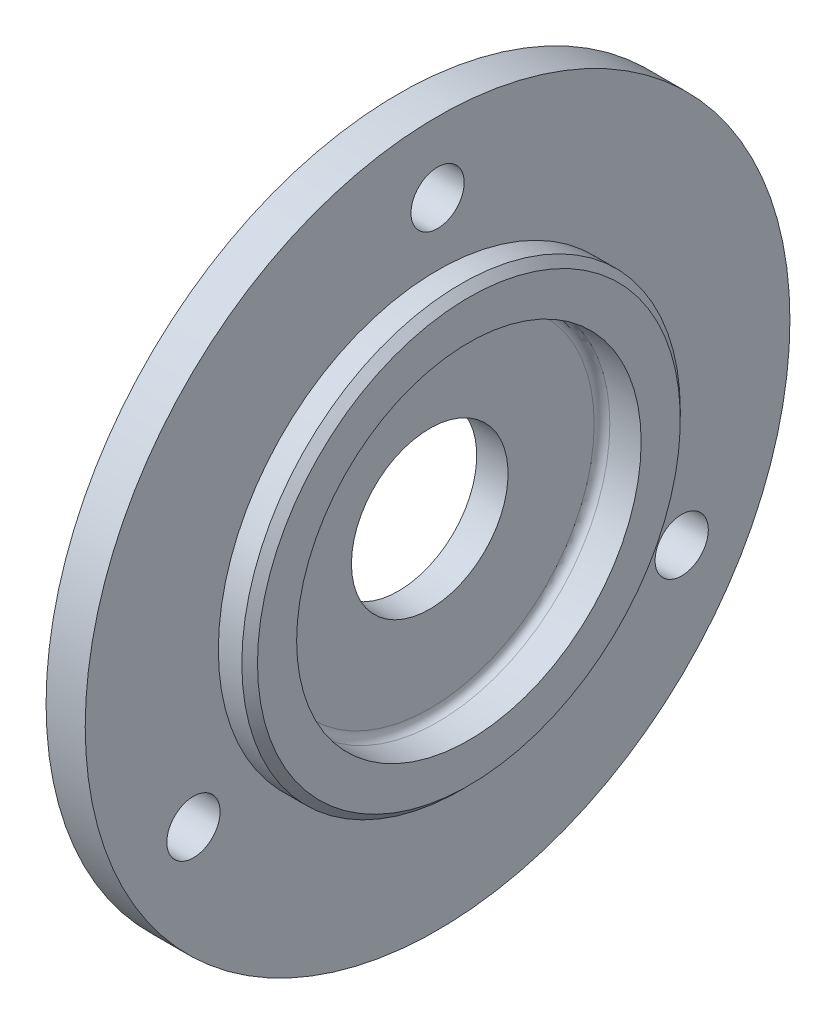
ISO-10303-21;
HEADER;
FILE_DESCRIPTION(('STEP AP214'),'2;1');
FILE_NAME('part.step','',(''),(''),'','','');
FILE_SCHEMA(('AUTOMOTIVE_DESIGN { 1 0 10303 214 1 1 1 1 }'));
ENDSEC;
DATA;
#1=APPLICATION_CONTEXT('core data for automotive mechanical design processes');
#2=APPLICATION_PROTOCOL_DEFINITION('international standard','automotive_design',2000,#1);
#3=PRODUCT_CONTEXT('',#1,'mechanical');
#4=PRODUCT('Part','Part','',(#3));
#5=PRODUCT_RELATED_PRODUCT_CATEGORY('part','',(#4));
#6=PRODUCT_DEFINITION_FORMATION('','',#4);
#7=PRODUCT_DEFINITION_CONTEXT('part definition',#1,'design');
#8=PRODUCT_DEFINITION('design','',#6,#7);
#9=PRODUCT_DEFINITION_SHAPE('','',#8);
#10=(LENGTH_UNIT() NAMED_UNIT(*) SI_UNIT(.MILLI.,.METRE.));
#11=(NAMED_UNIT(*) PLANE_ANGLE_UNIT() SI_UNIT($,.RADIAN.));
#12=(NAMED_UNIT(*) SI_UNIT($,.STERADIAN.) SOLID_ANGLE_UNIT());
#13=UNCERTAINTY_MEASURE_WITH_UNIT(LENGTH_MEASURE(1.E-05),#10,'distance_accuracy_value','');
#14=(GEOMETRIC_REPRESENTATION_CONTEXT(3) GLOBAL_UNCERTAINTY_ASSIGNED_CONTEXT((#13)) GLOBAL_UNIT_ASSIGNED_CONTEXT((#10,
#11,#12)) REPRESENTATION_CONTEXT('',''));
#15=CARTESIAN_POINT('',(0.,0.,0.));
#16=DIRECTION('',(0.,0.,1.));
#17=DIRECTION('',(1.,0.,0.));
#18=AXIS2_PLACEMENT_3D('',#15,#16,#17);
#19=CARTESIAN_POINT('',(-14.777796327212,0.,0.));
#20=DIRECTION('',(-1.,0.,0.));
#21=DIRECTION('',(0.,0.,1.));
#22=AXIS2_PLACEMENT_3D('',#19,#20,#21);
#23=CYLINDRICAL_SURFACE('',#22,5.);
#24=CARTESIAN_POINT('',(-0.499999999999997,0.,0.));
#25=DIRECTION('',(-1.,0.,0.));
#26=DIRECTION('',(0.,0.,1.));
#27=AXIS2_PLACEMENT_3D('',#24,#25,#26);
#28=CIRCLE('',#27,5.);
#29=CARTESIAN_POINT('',(-0.499999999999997,0.,5.));
#30=VERTEX_POINT('',#29);
#31=EDGE_CURVE('E65',#30,#30,#28,.T.);
#32=ORIENTED_EDGE('',*,*,#31,.F.);
#33=EDGE_LOOP('',(#32));
#34=FACE_BOUND('',#33,.T.);
#35=CARTESIAN_POINT('',(-2.5,0.,0.));
#36=DIRECTION('',(-1.,0.,0.));
#37=DIRECTION('',(0.,0.,1.));
#38=AXIS2_PLACEMENT_3D('',#35,#36,#37);
#39=CIRCLE('',#38,5.);
#40=CARTESIAN_POINT('',(-2.5,0.,5.));
#41=VERTEX_POINT('',#40);
#42=EDGE_CURVE('E10',#41,#41,#39,.T.);
#43=ORIENTED_EDGE('',*,*,#42,.T.);
#44=EDGE_LOOP('',(#43));
#45=FACE_BOUND('',#44,.T.);
#46=ADVANCED_FACE('F31',(#34,#45),#23,.F.);
#47=CARTESIAN_POINT('',(-2.5,22.5,0.));
#48=DIRECTION('',(1.,0.,0.));
#49=DIRECTION('',(0.,0.,-1.));
#50=AXIS2_PLACEMENT_3D('',#47,#48,#49);
#51=PLANE('',#50);
#52=CARTESIAN_POINT('',(-2.5,-8.99999999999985,15.58845726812));
#53=DIRECTION('',(1.,0.,0.));
#54=DIRECTION('',(0.,0.,-1.));
#55=AXIS2_PLACEMENT_3D('',#52,#53,#54);
#56=CIRCLE('',#55,1.7);
#57=CARTESIAN_POINT('',(-2.5,-8.99999999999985,13.88845726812));
#58=VERTEX_POINT('',#57);
#59=EDGE_CURVE('E80',#58,#58,#56,.T.);
#60=ORIENTED_EDGE('',*,*,#59,.T.);
#61=EDGE_LOOP('',(#60));
#62=FACE_BOUND('',#61,.T.);
#63=CARTESIAN_POINT('',(-2.5,-9.00000000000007,-15.5884572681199));
#64=DIRECTION('',(1.,0.,0.));
#65=DIRECTION('',(0.,0.,-1.));
#66=AXIS2_PLACEMENT_3D('',#63,#64,#65);
#67=CIRCLE('',#66,1.7);
#68=CARTESIAN_POINT('',(-2.5,-9.00000000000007,-17.2884572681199));
#69=VERTEX_POINT('',#68);
#70=EDGE_CURVE('E74',#69,#69,#67,.T.);
#71=ORIENTED_EDGE('',*,*,#70,.T.);
#72=EDGE_LOOP('',(#71));
#73=FACE_BOUND('',#72,.T.);
#74=CARTESIAN_POINT('',(-2.5,18.,0.));
#75=DIRECTION('',(1.,0.,0.));
#76=DIRECTION('',(0.,0.,-1.));
#77=AXIS2_PLACEMENT_3D('',#74,#75,#76);
#78=CIRCLE('',#77,1.7);
#79=CARTESIAN_POINT('',(-2.5,18.,-1.7));
#80=VERTEX_POINT('',#79);
#81=EDGE_CURVE('E68',#80,#80,#78,.T.);
#82=ORIENTED_EDGE('',*,*,#81,.T.);
#83=EDGE_LOOP('',(#82));
#84=FACE_BOUND('',#83,.T.);
#85=ORIENTED_EDGE('',*,*,#42,.F.);
#86=EDGE_LOOP('',(#85));
#87=FACE_BOUND('',#86,.T.);
#88=CARTESIAN_POINT('',(-2.5,0.,0.));
#89=DIRECTION('',(-1.,0.,0.));
#90=DIRECTION('',(0.,0.,1.));
#91=AXIS2_PLACEMENT_3D('',#88,#89,#90);
#92=CIRCLE('',#91,22.5);
#93=CARTESIAN_POINT('',(-2.5,0.,22.5));
#94=VERTEX_POINT('',#93);
#95=EDGE_CURVE('E37',#94,#94,#92,.T.);
#96=ORIENTED_EDGE('',*,*,#95,.T.);
#97=EDGE_LOOP('',(#96));
#98=FACE_BOUND('',#97,.T.);
#99=ADVANCED_FACE('F141',(#62,#73,#84,#87,#98),#51,.F.);
#100=CARTESIAN_POINT('',(-14.777796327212,0.,0.));
#101=DIRECTION('',(-1.,0.,0.));
#102=DIRECTION('',(0.,0.,1.));
#103=AXIS2_PLACEMENT_3D('',#100,#101,#102);
#104=CYLINDRICAL_SURFACE('',#103,22.5);
#105=ORIENTED_EDGE('',*,*,#95,.F.);
#106=EDGE_LOOP('',(#105));
#107=FACE_BOUND('',#106,.T.);
#108=CARTESIAN_POINT('',(0.,0.,0.));
#109=DIRECTION('',(-1.,0.,0.));
#110=DIRECTION('',(0.,0.,1.));
#111=AXIS2_PLACEMENT_3D('',#108,#109,#110);
#112=CIRCLE('',#111,22.5);
#113=CARTESIAN_POINT('',(0.,0.,22.5));
#114=VERTEX_POINT('',#113);
#115=EDGE_CURVE('E41',#114,#114,#112,.T.);
#116=ORIENTED_EDGE('',*,*,#115,.T.);
#117=EDGE_LOOP('',(#116));
#118=FACE_BOUND('',#117,.T.);
#119=ADVANCED_FACE('F94',(#107,#118),#104,.T.);
#120=CARTESIAN_POINT('',(0.,14.,0.));
#121=DIRECTION('',(-1.,0.,0.));
#122=DIRECTION('',(0.,0.,1.));
#123=AXIS2_PLACEMENT_3D('',#120,#121,#122);
#124=PLANE('',#123);
#125=CARTESIAN_POINT('',(0.,-8.99999999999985,15.58845726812));
#126=DIRECTION('',(1.,0.,0.));
#127=DIRECTION('',(0.,0.,-1.));
#128=AXIS2_PLACEMENT_3D('',#125,#126,#127);
#129=CIRCLE('',#128,1.7);
#130=CARTESIAN_POINT('',(0.,-8.99999999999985,13.88845726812));
#131=VERTEX_POINT('',#130);
#132=EDGE_CURVE('E83',#131,#131,#129,.T.);
#133=ORIENTED_EDGE('',*,*,#132,.F.);
#134=EDGE_LOOP('',(#133));
#135=FACE_BOUND('',#134,.T.);
#136=CARTESIAN_POINT('',(0.,-9.00000000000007,-15.5884572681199));
#137=DIRECTION('',(1.,0.,0.));
#138=DIRECTION('',(0.,0.,-1.));
#139=AXIS2_PLACEMENT_3D('',#136,#137,#138);
#140=CIRCLE('',#139,1.7);
#141=CARTESIAN_POINT('',(0.,-9.00000000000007,-17.2884572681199));
#142=VERTEX_POINT('',#141);
#143=EDGE_CURVE('E77',#142,#142,#140,.T.);
#144=ORIENTED_EDGE('',*,*,#143,.F.);
#145=EDGE_LOOP('',(#144));
#146=FACE_BOUND('',#145,.T.);
#147=CARTESIAN_POINT('',(0.,18.,0.));
#148=DIRECTION('',(1.,0.,0.));
#149=DIRECTION('',(0.,0.,-1.));
#150=AXIS2_PLACEMENT_3D('',#147,#148,#149);
#151=CIRCLE('',#150,1.7);
#152=CARTESIAN_POINT('',(0.,18.,-1.7));
#153=VERTEX_POINT('',#152);
#154=EDGE_CURVE('E71',#153,#153,#151,.T.);
#155=ORIENTED_EDGE('',*,*,#154,.F.);
#156=EDGE_LOOP('',(#155));
#157=FACE_BOUND('',#156,.T.);
#158=ORIENTED_EDGE('',*,*,#115,.F.);
#159=EDGE_LOOP('',(#158));
#160=FACE_BOUND('',#159,.T.);
#161=CARTESIAN_POINT('',(0.,0.,0.));
#162=DIRECTION('',(-1.,0.,0.));
#163=DIRECTION('',(0.,0.,1.));
#164=AXIS2_PLACEMENT_3D('',#161,#162,#163);
#165=CIRCLE('',#164,14.);
#166=CARTESIAN_POINT('',(0.,0.,14.));
#167=VERTEX_POINT('',#166);
#168=EDGE_CURVE('E45',#167,#167,#165,.T.);
#169=ORIENTED_EDGE('',*,*,#168,.T.);
#170=EDGE_LOOP('',(#169));
#171=FACE_BOUND('',#170,.T.);
#172=ADVANCED_FACE('F90',(#135,#146,#157,#160,#171),#124,.F.);
#173=CARTESIAN_POINT('',(-14.777796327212,0.,0.));
#174=DIRECTION('',(-1.,0.,0.));
#175=DIRECTION('',(0.,0.,1.));
#176=AXIS2_PLACEMENT_3D('',#173,#174,#175);
#177=CYLINDRICAL_SURFACE('',#176,14.);
#178=ORIENTED_EDGE('',*,*,#168,.F.);
#179=EDGE_LOOP('',(#178));
#180=FACE_BOUND('',#179,.T.);
#181=CARTESIAN_POINT('',(1.5,0.,0.));
#182=DIRECTION('',(-1.,0.,0.));
#183=DIRECTION('',(0.,0.,1.));
#184=AXIS2_PLACEMENT_3D('',#181,#182,#183);
#185=CIRCLE('',#184,14.);
#186=CARTESIAN_POINT('',(1.5,0.,14.));
#187=VERTEX_POINT('',#186);
#188=EDGE_CURVE('E50',#187,#187,#185,.T.);
#189=ORIENTED_EDGE('',*,*,#188,.T.);
#190=EDGE_LOOP('',(#189));
#191=FACE_BOUND('',#190,.T.);
#192=ADVANCED_FACE('F93',(#180,#191),#177,.T.);
#193=CARTESIAN_POINT('',(2.,0.,0.));
#194=DIRECTION('',(-1.,0.,0.));
#195=DIRECTION('',(0.,0.,1.));
#196=AXIS2_PLACEMENT_3D('',#193,#194,#195);
#197=CONICAL_SURFACE('',#196,13.5,0.785398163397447);
#198=ORIENTED_EDGE('',*,*,#188,.F.);
#199=EDGE_LOOP('',(#198));
#200=FACE_BOUND('',#199,.T.);
#201=CARTESIAN_POINT('',(2.,0.,0.));
#202=DIRECTION('',(-1.,0.,0.));
#203=DIRECTION('',(0.,0.,1.));
#204=AXIS2_PLACEMENT_3D('',#201,#202,#203);
#205=CIRCLE('',#204,13.5);
#206=CARTESIAN_POINT('',(2.,0.,13.5));
#207=VERTEX_POINT('',#206);
#208=EDGE_CURVE('E53',#207,#207,#205,.T.);
#209=ORIENTED_EDGE('',*,*,#208,.T.);
#210=EDGE_LOOP('',(#209));
#211=FACE_BOUND('',#210,.T.);
#212=ADVANCED_FACE('F106',(#200,#211),#197,.T.);
#213=CARTESIAN_POINT('',(2.,11.,0.));
#214=DIRECTION('',(-1.,0.,0.));
#215=DIRECTION('',(0.,0.,1.));
#216=AXIS2_PLACEMENT_3D('',#213,#214,#215);
#217=PLANE('',#216);
#218=ORIENTED_EDGE('',*,*,#208,.F.);
#219=EDGE_LOOP('',(#218));
#220=FACE_BOUND('',#219,.T.);
#221=CARTESIAN_POINT('',(2.,0.,0.));
#222=DIRECTION('',(-1.,0.,0.));
#223=DIRECTION('',(0.,0.,1.));
#224=AXIS2_PLACEMENT_3D('',#221,#222,#223);
#225=CIRCLE('',#224,11.);
#226=CARTESIAN_POINT('',(2.,0.,11.));
#227=VERTEX_POINT('',#226);
#228=EDGE_CURVE('E56',#227,#227,#225,.T.);
#229=ORIENTED_EDGE('',*,*,#228,.T.);
#230=EDGE_LOOP('',(#229));
#231=FACE_BOUND('',#230,.T.);
#232=ADVANCED_FACE('F112',(#220,#231),#217,.F.);
#233=CARTESIAN_POINT('',(-14.777796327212,0.,0.));
#234=DIRECTION('',(-1.,0.,0.));
#235=DIRECTION('',(0.,0.,1.));
#236=AXIS2_PLACEMENT_3D('',#233,#234,#235);
#237=CYLINDRICAL_SURFACE('',#236,11.);
#238=ORIENTED_EDGE('',*,*,#228,.F.);
#239=EDGE_LOOP('',(#238));
#240=FACE_BOUND('',#239,.T.);
#241=CARTESIAN_POINT('',(0.,0.,0.));
#242=DIRECTION('',(-1.,0.,0.));
#243=DIRECTION('',(0.,0.,1.));
#244=AXIS2_PLACEMENT_3D('',#241,#242,#243);
#245=CIRCLE('',#244,11.);
#246=CARTESIAN_POINT('',(0.,0.,11.));
#247=VERTEX_POINT('',#246);
#248=EDGE_CURVE('E59',#247,#247,#245,.T.);
#249=ORIENTED_EDGE('',*,*,#248,.T.);
#250=EDGE_LOOP('',(#249));
#251=FACE_BOUND('',#250,.T.);
#252=ADVANCED_FACE('F118',(#240,#251),#237,.F.);
#253=CARTESIAN_POINT('',(0.,0.,0.));
#254=DIRECTION('',(-1.,0.,0.));
#255=DIRECTION('',(0.,0.,1.));
#256=AXIS2_PLACEMENT_3D('',#253,#254,#255);
#257=TOROIDAL_SURFACE('',#256,10.5,0.5);
#258=ORIENTED_EDGE('',*,*,#248,.F.);
#259=EDGE_LOOP('',(#258));
#260=FACE_BOUND('',#259,.T.);
#261=CARTESIAN_POINT('',(-0.499999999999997,0.,0.));
#262=DIRECTION('',(-1.,0.,0.));
#263=DIRECTION('',(0.,0.,1.));
#264=AXIS2_PLACEMENT_3D('',#261,#262,#263);
#265=CIRCLE('',#264,10.5);
#266=CARTESIAN_POINT('',(-0.499999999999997,0.,10.5));
#267=VERTEX_POINT('',#266);
#268=EDGE_CURVE('E62',#267,#267,#265,.T.);
#269=ORIENTED_EDGE('',*,*,#268,.T.);
#270=EDGE_LOOP('',(#269));
#271=FACE_BOUND('',#270,.T.);
#272=ADVANCED_FACE('F124',(#260,#271),#257,.F.);
#273=CARTESIAN_POINT('',(-0.499999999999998,5.,0.));
#274=DIRECTION('',(-1.,0.,0.));
#275=DIRECTION('',(0.,0.,1.));
#276=AXIS2_PLACEMENT_3D('',#273,#274,#275);
#277=PLANE('',#276);
#278=ORIENTED_EDGE('',*,*,#268,.F.);
#279=EDGE_LOOP('',(#278));
#280=FACE_BOUND('',#279,.T.);
#281=ORIENTED_EDGE('',*,*,#31,.T.);
#282=EDGE_LOOP('',(#281));
#283=FACE_BOUND('',#282,.T.);
#284=ADVANCED_FACE('F130',(#280,#283),#277,.F.);
#285=CARTESIAN_POINT('',(-10.,18.,0.));
#286=DIRECTION('',(1.,0.,0.));
#287=DIRECTION('',(0.,0.,-1.));
#288=AXIS2_PLACEMENT_3D('',#285,#286,#287);
#289=CYLINDRICAL_SURFACE('',#288,1.7);
#290=ORIENTED_EDGE('',*,*,#154,.T.);
#291=EDGE_LOOP('',(#290));
#292=FACE_BOUND('',#291,.T.);
#293=ORIENTED_EDGE('',*,*,#81,.F.);
#294=EDGE_LOOP('',(#293));
#295=FACE_BOUND('',#294,.T.);
#296=ADVANCED_FACE('F136',(#292,#295),#289,.F.);
#297=CARTESIAN_POINT('',(-10.,-9.00000000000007,-15.5884572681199));
#298=DIRECTION('',(1.,0.,0.));
#299=DIRECTION('',(0.,0.,-1.));
#300=AXIS2_PLACEMENT_3D('',#297,#298,#299);
#301=CYLINDRICAL_SURFACE('',#300,1.7);
#302=ORIENTED_EDGE('',*,*,#143,.T.);
#303=EDGE_LOOP('',(#302));
#304=FACE_BOUND('',#303,.T.);
#305=ORIENTED_EDGE('',*,*,#70,.F.);
#306=EDGE_LOOP('',(#305));
#307=FACE_BOUND('',#306,.T.);
#308=ADVANCED_FACE('F155',(#304,#307),#301,.F.);
#309=CARTESIAN_POINT('',(-10.,-8.99999999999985,15.58845726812));
#310=DIRECTION('',(1.,0.,0.));
#311=DIRECTION('',(0.,0.,-1.));
#312=AXIS2_PLACEMENT_3D('',#309,#310,#311);
#313=CYLINDRICAL_SURFACE('',#312,1.7);
#314=ORIENTED_EDGE('',*,*,#132,.T.);
#315=EDGE_LOOP('',(#314));
#316=FACE_BOUND('',#315,.T.);
#317=ORIENTED_EDGE('',*,*,#59,.F.);
#318=EDGE_LOOP('',(#317));
#319=FACE_BOUND('',#318,.T.);
#320=ADVANCED_FACE('F87',(#316,#319),#313,.F.);
#321=CLOSED_SHELL('',(#46,#99,#119,#172,#192,#212,#232,#252,#272,#284,#296,#308,#320));
#322=MANIFOLD_SOLID_BREP('B2',#321);
#323=ADVANCED_BREP_SHAPE_REPRESENTATION('',(#18,#322),#14);
#324=SHAPE_DEFINITION_REPRESENTATION(#9,#323);
ENDSEC;
END-ISO-10303-21;
